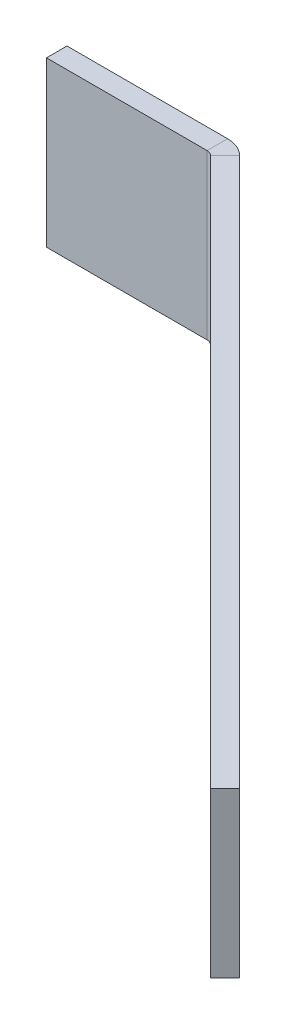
ISO-10303-21;
HEADER;
FILE_DESCRIPTION(('STEP AP214'),'2;1');
FILE_NAME('part.step','',(''),(''),'','','');
FILE_SCHEMA(('AUTOMOTIVE_DESIGN { 1 0 10303 214 1 1 1 1 }'));
ENDSEC;
DATA;
#1=APPLICATION_CONTEXT('core data for automotive mechanical design processes');
#2=APPLICATION_PROTOCOL_DEFINITION('international standard','automotive_design',2000,#1);
#3=PRODUCT_CONTEXT('',#1,'mechanical');
#4=PRODUCT('Part','Part','',(#3));
#5=PRODUCT_RELATED_PRODUCT_CATEGORY('part','',(#4));
#6=PRODUCT_DEFINITION_FORMATION('','',#4);
#7=PRODUCT_DEFINITION_CONTEXT('part definition',#1,'design');
#8=PRODUCT_DEFINITION('design','',#6,#7);
#9=PRODUCT_DEFINITION_SHAPE('','',#8);
#10=(LENGTH_UNIT() NAMED_UNIT(*) SI_UNIT(.MILLI.,.METRE.));
#11=(NAMED_UNIT(*) PLANE_ANGLE_UNIT() SI_UNIT($,.RADIAN.));
#12=(NAMED_UNIT(*) SI_UNIT($,.STERADIAN.) SOLID_ANGLE_UNIT());
#13=UNCERTAINTY_MEASURE_WITH_UNIT(LENGTH_MEASURE(1.E-05),#10,'distance_accuracy_value','');
#14=(GEOMETRIC_REPRESENTATION_CONTEXT(3) GLOBAL_UNCERTAINTY_ASSIGNED_CONTEXT((#13)) GLOBAL_UNIT_ASSIGNED_CONTEXT((#10,
#11,#12)) REPRESENTATION_CONTEXT('',''));
#15=CARTESIAN_POINT('',(0.,0.,0.));
#16=DIRECTION('',(0.,0.,1.));
#17=DIRECTION('',(1.,0.,0.));
#18=AXIS2_PLACEMENT_3D('',#15,#16,#17);
#19=CARTESIAN_POINT('',(-1.57815367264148,76.2,0.));
#20=DIRECTION('',(0.,1.,0.));
#21=DIRECTION('',(0.,0.,1.));
#22=AXIS2_PLACEMENT_3D('',#19,#20,#21);
#23=PLANE('',#22);
#24=DIRECTION('',(0.,0.,-1.));
#25=VECTOR('',#24,1.);
#26=CARTESIAN_POINT('',(-1.57815367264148,76.2,0.));
#27=LINE('',#26,#25);
#28=CARTESIAN_POINT('',(-1.57815367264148,76.2,0.));
#29=VERTEX_POINT('',#28);
#30=CARTESIAN_POINT('',(-1.57815367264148,76.2,-9.525));
#31=VERTEX_POINT('',#30);
#32=EDGE_CURVE('E11',#29,#31,#27,.T.);
#33=ORIENTED_EDGE('',*,*,#32,.F.);
#34=CARTESIAN_POINT('',(-1.57815367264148,76.2,3.81));
#35=DIRECTION('',(0.,1.,0.));
#36=DIRECTION('',(0.,0.,1.));
#37=AXIS2_PLACEMENT_3D('',#34,#35,#36);
#38=CIRCLE('',#37,3.81);
#39=CARTESIAN_POINT('',(1.11592316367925,76.2,1.11592316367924));
#40=VERTEX_POINT('',#39);
#41=EDGE_CURVE('E126',#29,#40,#38,.F.);
#42=ORIENTED_EDGE('',*,*,#41,.T.);
#43=DIRECTION('',(-0.707106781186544,0.,0.707106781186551));
#44=VECTOR('',#43,1.);
#45=CARTESIAN_POINT('',(7.85111525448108,76.2,-5.61926892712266));
#46=LINE('',#45,#44);
#47=CARTESIAN_POINT('',(7.85111525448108,76.2,-5.61926892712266));
#48=VERTEX_POINT('',#47);
#49=EDGE_CURVE('E44',#48,#40,#46,.T.);
#50=ORIENTED_EDGE('',*,*,#49,.F.);
#51=CARTESIAN_POINT('',(-1.57815367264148,76.2,3.81));
#52=DIRECTION('',(0.,1.,0.));
#53=DIRECTION('',(1.,0.,0.));
#54=AXIS2_PLACEMENT_3D('',#51,#52,#53);
#55=CIRCLE('',#54,13.335);
#56=EDGE_CURVE('E133',#31,#48,#55,.F.);
#57=ORIENTED_EDGE('',*,*,#56,.F.);
#58=EDGE_LOOP('',(#33,#42,#50,#57));
#59=FACE_BOUND('',#58,.T.);
#60=ADVANCED_FACE('F36',(#59),#23,.T.);
#61=CARTESIAN_POINT('',(7.85111525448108,76.2,-5.61926892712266));
#62=DIRECTION('',(0.,1.,0.));
#63=DIRECTION('',(0.,0.,1.));
#64=AXIS2_PLACEMENT_3D('',#61,#62,#63);
#65=PLANE('',#64);
#66=DIRECTION('',(1.,0.,0.));
#67=VECTOR('',#66,1.);
#68=CARTESIAN_POINT('',(0.,76.2,0.));
#69=LINE('',#68,#67);
#70=CARTESIAN_POINT('',(-76.2,76.2,0.));
#71=VERTEX_POINT('',#70);
#72=EDGE_CURVE('E121',#71,#29,#69,.T.);
#73=ORIENTED_EDGE('',*,*,#72,.T.);
#74=ORIENTED_EDGE('',*,*,#32,.T.);
#75=DIRECTION('',(1.,0.,0.));
#76=VECTOR('',#75,1.);
#77=CARTESIAN_POINT('',(0.,76.2,-9.525));
#78=LINE('',#77,#76);
#79=CARTESIAN_POINT('',(-76.2,76.2,-9.52499999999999));
#80=VERTEX_POINT('',#79);
#81=EDGE_CURVE('E131',#80,#31,#78,.T.);
#82=ORIENTED_EDGE('',*,*,#81,.F.);
#83=DIRECTION('',(0.,0.,-1.));
#84=VECTOR('',#83,1.);
#85=CARTESIAN_POINT('',(-76.2,76.2,0.));
#86=LINE('',#85,#84);
#87=EDGE_CURVE('E112',#71,#80,#86,.T.);
#88=ORIENTED_EDGE('',*,*,#87,.F.);
#89=EDGE_LOOP('',(#73,#74,#82,#88));
#90=FACE_BOUND('',#89,.T.);
#91=ADVANCED_FACE('F129',(#90),#65,.T.);
#92=CARTESIAN_POINT('',(1.11592316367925,0.,1.11592316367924));
#93=DIRECTION('',(0.,-1.,0.));
#94=DIRECTION('',(0.,0.,-1.));
#95=AXIS2_PLACEMENT_3D('',#92,#93,#94);
#96=PLANE('',#95);
#97=DIRECTION('',(0.707106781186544,0.,-0.707106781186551));
#98=VECTOR('',#97,1.);
#99=CARTESIAN_POINT('',(1.11592316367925,0.,1.11592316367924));
#100=LINE('',#99,#98);
#101=CARTESIAN_POINT('',(1.11592316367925,0.,1.11592316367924));
#102=VERTEX_POINT('',#101);
#103=CARTESIAN_POINT('',(7.85111525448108,0.,-5.61926892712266));
#104=VERTEX_POINT('',#103);
#105=EDGE_CURVE('E87',#102,#104,#100,.T.);
#106=ORIENTED_EDGE('',*,*,#105,.F.);
#107=CARTESIAN_POINT('',(-1.57815367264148,0.,3.81));
#108=DIRECTION('',(0.,1.,0.));
#109=DIRECTION('',(0.,0.,1.));
#110=AXIS2_PLACEMENT_3D('',#107,#108,#109);
#111=CIRCLE('',#110,3.81);
#112=CARTESIAN_POINT('',(-1.57815367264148,0.,0.));
#113=VERTEX_POINT('',#112);
#114=EDGE_CURVE('E155',#113,#102,#111,.F.);
#115=ORIENTED_EDGE('',*,*,#114,.F.);
#116=DIRECTION('',(0.,0.,1.));
#117=VECTOR('',#116,1.);
#118=CARTESIAN_POINT('',(-1.57815367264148,0.,-9.525));
#119=LINE('',#118,#117);
#120=CARTESIAN_POINT('',(-1.57815367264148,0.,-9.525));
#121=VERTEX_POINT('',#120);
#122=EDGE_CURVE('E80',#121,#113,#119,.T.);
#123=ORIENTED_EDGE('',*,*,#122,.F.);
#124=CARTESIAN_POINT('',(-1.57815367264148,0.,3.81));
#125=DIRECTION('',(0.,1.,0.));
#126=DIRECTION('',(1.,0.,0.));
#127=AXIS2_PLACEMENT_3D('',#124,#125,#126);
#128=CIRCLE('',#127,13.335);
#129=EDGE_CURVE('E148',#121,#104,#128,.F.);
#130=ORIENTED_EDGE('',*,*,#129,.T.);
#131=EDGE_LOOP('',(#106,#115,#123,#130));
#132=FACE_BOUND('',#131,.T.);
#133=ADVANCED_FACE('F187',(#132),#96,.T.);
#134=CARTESIAN_POINT('',(-1.57815367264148,0.,-9.525));
#135=DIRECTION('',(0.,-1.,0.));
#136=DIRECTION('',(0.,0.,-1.));
#137=AXIS2_PLACEMENT_3D('',#134,#135,#136);
#138=PLANE('',#137);
#139=DIRECTION('',(0.707106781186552,0.,0.707106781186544));
#140=VECTOR('',#139,1.);
#141=CARTESIAN_POINT('',(0.,0.,0.));
#142=LINE('',#141,#140);
#143=CARTESIAN_POINT('',(255.937299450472,0.,255.937299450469));
#144=VERTEX_POINT('',#143);
#145=EDGE_CURVE('E139',#102,#144,#142,.T.);
#146=ORIENTED_EDGE('',*,*,#145,.F.);
#147=ORIENTED_EDGE('',*,*,#105,.T.);
#148=DIRECTION('',(0.707106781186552,0.,0.707106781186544));
#149=VECTOR('',#148,1.);
#150=CARTESIAN_POINT('',(6.73519209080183,0.,-6.7351920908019));
#151=LINE('',#150,#149);
#152=CARTESIAN_POINT('',(262.672491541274,0.,249.202107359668));
#153=VERTEX_POINT('',#152);
#154=EDGE_CURVE('E145',#104,#153,#151,.T.);
#155=ORIENTED_EDGE('',*,*,#154,.T.);
#156=DIRECTION('',(-0.707106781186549,0.,0.707106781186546));
#157=VECTOR('',#156,1.);
#158=CARTESIAN_POINT('',(262.672491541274,0.,249.202107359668));
#159=LINE('',#158,#157);
#160=EDGE_CURVE('E142',#153,#144,#159,.T.);
#161=ORIENTED_EDGE('',*,*,#160,.T.);
#162=EDGE_LOOP('',(#146,#147,#155,#161));
#163=FACE_BOUND('',#162,.T.);
#164=ADVANCED_FACE('F174',(#163),#138,.T.);
#165=CARTESIAN_POINT('',(0.,76.2,0.));
#166=DIRECTION('',(0.707106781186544,0.,-0.707106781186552));
#167=DIRECTION('',(-0.707106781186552,0.,-0.707106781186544));
#168=AXIS2_PLACEMENT_3D('',#165,#166,#167);
#169=PLANE('',#168);
#170=ORIENTED_EDGE('',*,*,#145,.T.);
#171=DIRECTION('',(0.,-1.,0.));
#172=VECTOR('',#171,1.);
#173=CARTESIAN_POINT('',(255.937299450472,76.2,255.937299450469));
#174=LINE('',#173,#172);
#175=CARTESIAN_POINT('',(255.937299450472,76.2,255.937299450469));
#176=VERTEX_POINT('',#175);
#177=EDGE_CURVE('E169',#176,#144,#174,.T.);
#178=ORIENTED_EDGE('',*,*,#177,.F.);
#179=DIRECTION('',(0.707106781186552,0.,0.707106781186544));
#180=VECTOR('',#179,1.);
#181=CARTESIAN_POINT('',(0.,76.2,0.));
#182=LINE('',#181,#180);
#183=EDGE_CURVE('E93',#40,#176,#182,.T.);
#184=ORIENTED_EDGE('',*,*,#183,.F.);
#185=DIRECTION('',(0.,-1.,0.));
#186=VECTOR('',#185,1.);
#187=CARTESIAN_POINT('',(1.11592316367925,76.2,1.11592316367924));
#188=LINE('',#187,#186);
#189=EDGE_CURVE('E138',#40,#102,#188,.T.);
#190=ORIENTED_EDGE('',*,*,#189,.T.);
#191=EDGE_LOOP('',(#170,#178,#184,#190));
#192=FACE_BOUND('',#191,.T.);
#193=ADVANCED_FACE('F223',(#192),#169,.F.);
#194=CARTESIAN_POINT('',(262.672491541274,76.2,249.202107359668));
#195=DIRECTION('',(0.707106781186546,0.,0.707106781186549));
#196=DIRECTION('',(0.707106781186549,0.,-0.707106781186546));
#197=AXIS2_PLACEMENT_3D('',#194,#195,#196);
#198=PLANE('',#197);
#199=ORIENTED_EDGE('',*,*,#160,.F.);
#200=DIRECTION('',(0.,-1.,0.));
#201=VECTOR('',#200,1.);
#202=CARTESIAN_POINT('',(262.672491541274,76.2,249.202107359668));
#203=LINE('',#202,#201);
#204=CARTESIAN_POINT('',(262.672491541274,76.2,249.202107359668));
#205=VERTEX_POINT('',#204);
#206=EDGE_CURVE('E167',#205,#153,#203,.T.);
#207=ORIENTED_EDGE('',*,*,#206,.F.);
#208=DIRECTION('',(-0.707106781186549,0.,0.707106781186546));
#209=VECTOR('',#208,1.);
#210=CARTESIAN_POINT('',(262.672491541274,76.2,249.202107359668));
#211=LINE('',#210,#209);
#212=EDGE_CURVE('E193',#205,#176,#211,.T.);
#213=ORIENTED_EDGE('',*,*,#212,.T.);
#214=ORIENTED_EDGE('',*,*,#177,.T.);
#215=EDGE_LOOP('',(#199,#207,#213,#214));
#216=FACE_BOUND('',#215,.T.);
#217=ADVANCED_FACE('F199',(#216),#198,.T.);
#218=CARTESIAN_POINT('',(6.73519209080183,76.2,-6.7351920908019));
#219=DIRECTION('',(0.707106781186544,0.,-0.707106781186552));
#220=DIRECTION('',(-0.707106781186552,0.,-0.707106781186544));
#221=AXIS2_PLACEMENT_3D('',#218,#219,#220);
#222=PLANE('',#221);
#223=ORIENTED_EDGE('',*,*,#154,.F.);
#224=DIRECTION('',(0.,-1.,0.));
#225=VECTOR('',#224,1.);
#226=CARTESIAN_POINT('',(7.85111525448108,76.2,-5.61926892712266));
#227=LINE('',#226,#225);
#228=EDGE_CURVE('E164',#48,#104,#227,.T.);
#229=ORIENTED_EDGE('',*,*,#228,.F.);
#230=DIRECTION('',(0.707106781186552,0.,0.707106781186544));
#231=VECTOR('',#230,1.);
#232=CARTESIAN_POINT('',(6.73519209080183,76.2,-6.7351920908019));
#233=LINE('',#232,#231);
#234=EDGE_CURVE('E192',#48,#205,#233,.T.);
#235=ORIENTED_EDGE('',*,*,#234,.T.);
#236=ORIENTED_EDGE('',*,*,#206,.T.);
#237=EDGE_LOOP('',(#223,#229,#235,#236));
#238=FACE_BOUND('',#237,.T.);
#239=ADVANCED_FACE('F185',(#238),#222,.T.);
#240=CARTESIAN_POINT('',(-1.57815367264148,76.2,3.81));
#241=DIRECTION('',(0.,-1.,0.));
#242=DIRECTION('',(0.,0.,-1.));
#243=AXIS2_PLACEMENT_3D('',#240,#241,#242);
#244=CYLINDRICAL_SURFACE('',#243,13.335);
#245=ORIENTED_EDGE('',*,*,#129,.F.);
#246=DIRECTION('',(0.,-1.,0.));
#247=VECTOR('',#246,1.);
#248=CARTESIAN_POINT('',(-1.57815367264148,76.2,-9.525));
#249=LINE('',#248,#247);
#250=EDGE_CURVE('E161',#31,#121,#249,.T.);
#251=ORIENTED_EDGE('',*,*,#250,.F.);
#252=ORIENTED_EDGE('',*,*,#56,.T.);
#253=ORIENTED_EDGE('',*,*,#228,.T.);
#254=EDGE_LOOP('',(#245,#251,#252,#253));
#255=FACE_BOUND('',#254,.T.);
#256=ADVANCED_FACE('F180',(#255),#244,.T.);
#257=CARTESIAN_POINT('',(0.,76.2,-9.525));
#258=DIRECTION('',(0.,0.,-1.));
#259=DIRECTION('',(-1.,0.,0.));
#260=AXIS2_PLACEMENT_3D('',#257,#258,#259);
#261=PLANE('',#260);
#262=DIRECTION('',(1.,0.,0.));
#263=VECTOR('',#262,1.);
#264=CARTESIAN_POINT('',(0.,0.,-9.525));
#265=LINE('',#264,#263);
#266=CARTESIAN_POINT('',(-76.2,0.,-9.52499999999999));
#267=VERTEX_POINT('',#266);
#268=EDGE_CURVE('E150',#267,#121,#265,.T.);
#269=ORIENTED_EDGE('',*,*,#268,.F.);
#270=DIRECTION('',(0.,-1.,0.));
#271=VECTOR('',#270,1.);
#272=CARTESIAN_POINT('',(-76.2,76.2,-9.52499999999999));
#273=LINE('',#272,#271);
#274=EDGE_CURVE('E116',#80,#267,#273,.T.);
#275=ORIENTED_EDGE('',*,*,#274,.F.);
#276=ORIENTED_EDGE('',*,*,#81,.T.);
#277=ORIENTED_EDGE('',*,*,#250,.T.);
#278=EDGE_LOOP('',(#269,#275,#276,#277));
#279=FACE_BOUND('',#278,.T.);
#280=ADVANCED_FACE('F190',(#279),#261,.T.);
#281=CARTESIAN_POINT('',(-76.2,76.2,0.));
#282=DIRECTION('',(-1.,0.,0.));
#283=DIRECTION('',(0.,0.,1.));
#284=AXIS2_PLACEMENT_3D('',#281,#282,#283);
#285=PLANE('',#284);
#286=DIRECTION('',(0.,0.,-1.));
#287=VECTOR('',#286,1.);
#288=CARTESIAN_POINT('',(-76.2,0.,0.));
#289=LINE('',#288,#287);
#290=CARTESIAN_POINT('',(-76.2,0.,0.));
#291=VERTEX_POINT('',#290);
#292=EDGE_CURVE('E114',#291,#267,#289,.T.);
#293=ORIENTED_EDGE('',*,*,#292,.F.);
#294=DIRECTION('',(0.,-1.,0.));
#295=VECTOR('',#294,1.);
#296=CARTESIAN_POINT('',(-76.2,76.2,0.));
#297=LINE('',#296,#295);
#298=EDGE_CURVE('E108',#71,#291,#297,.T.);
#299=ORIENTED_EDGE('',*,*,#298,.F.);
#300=ORIENTED_EDGE('',*,*,#87,.T.);
#301=ORIENTED_EDGE('',*,*,#274,.T.);
#302=EDGE_LOOP('',(#293,#299,#300,#301));
#303=FACE_BOUND('',#302,.T.);
#304=ADVANCED_FACE('F110',(#303),#285,.T.);
#305=CARTESIAN_POINT('',(0.,76.2,0.));
#306=DIRECTION('',(0.,0.,-1.));
#307=DIRECTION('',(-1.,0.,0.));
#308=AXIS2_PLACEMENT_3D('',#305,#306,#307);
#309=PLANE('',#308);
#310=DIRECTION('',(1.,0.,0.));
#311=VECTOR('',#310,1.);
#312=CARTESIAN_POINT('',(0.,0.,0.));
#313=LINE('',#312,#311);
#314=EDGE_CURVE('E153',#291,#113,#313,.T.);
#315=ORIENTED_EDGE('',*,*,#314,.T.);
#316=DIRECTION('',(0.,-1.,0.));
#317=VECTOR('',#316,1.);
#318=CARTESIAN_POINT('',(-1.57815367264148,76.2,0.));
#319=LINE('',#318,#317);
#320=EDGE_CURVE('E117',#29,#113,#319,.T.);
#321=ORIENTED_EDGE('',*,*,#320,.F.);
#322=ORIENTED_EDGE('',*,*,#72,.F.);
#323=ORIENTED_EDGE('',*,*,#298,.T.);
#324=EDGE_LOOP('',(#315,#321,#322,#323));
#325=FACE_BOUND('',#324,.T.);
#326=ADVANCED_FACE('F122',(#325),#309,.F.);
#327=CARTESIAN_POINT('',(-1.57815367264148,76.2,3.81));
#328=DIRECTION('',(0.,-1.,0.));
#329=DIRECTION('',(0.,0.,-1.));
#330=AXIS2_PLACEMENT_3D('',#327,#328,#329);
#331=CYLINDRICAL_SURFACE('',#330,3.81);
#332=ORIENTED_EDGE('',*,*,#114,.T.);
#333=ORIENTED_EDGE('',*,*,#189,.F.);
#334=ORIENTED_EDGE('',*,*,#41,.F.);
#335=ORIENTED_EDGE('',*,*,#320,.T.);
#336=EDGE_LOOP('',(#332,#333,#334,#335));
#337=FACE_BOUND('',#336,.T.);
#338=ADVANCED_FACE('F203',(#337),#331,.F.);
#339=CARTESIAN_POINT('',(-1.57815367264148,76.2,3.81));
#340=DIRECTION('',(0.,1.,0.));
#341=DIRECTION('',(1.,0.,0.));
#342=AXIS2_PLACEMENT_3D('',#339,#340,#341);
#343=PLANE('',#342);
#344=ORIENTED_EDGE('',*,*,#183,.T.);
#345=ORIENTED_EDGE('',*,*,#212,.F.);
#346=ORIENTED_EDGE('',*,*,#234,.F.);
#347=ORIENTED_EDGE('',*,*,#49,.T.);
#348=EDGE_LOOP('',(#344,#345,#346,#347));
#349=FACE_BOUND('',#348,.T.);
#350=ADVANCED_FACE('F200',(#349),#343,.T.);
#351=CARTESIAN_POINT('',(-1.57815367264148,0.,3.81));
#352=DIRECTION('',(0.,1.,0.));
#353=DIRECTION('',(1.,0.,0.));
#354=AXIS2_PLACEMENT_3D('',#351,#352,#353);
#355=PLANE('',#354);
#356=ORIENTED_EDGE('',*,*,#268,.T.);
#357=ORIENTED_EDGE('',*,*,#122,.T.);
#358=ORIENTED_EDGE('',*,*,#314,.F.);
#359=ORIENTED_EDGE('',*,*,#292,.T.);
#360=EDGE_LOOP('',(#356,#357,#358,#359));
#361=FACE_BOUND('',#360,.T.);
#362=ADVANCED_FACE('F202',(#361),#355,.F.);
#363=CLOSED_SHELL('',(#60,#91,#133,#164,#193,#217,#239,#256,#280,#304,#326,#338,#350,#362));
#364=MANIFOLD_SOLID_BREP('B2',#363);
#365=ADVANCED_BREP_SHAPE_REPRESENTATION('',(#18,#364),#14);
#366=SHAPE_DEFINITION_REPRESENTATION(#9,#365);
ENDSEC;
END-ISO-10303-21;
